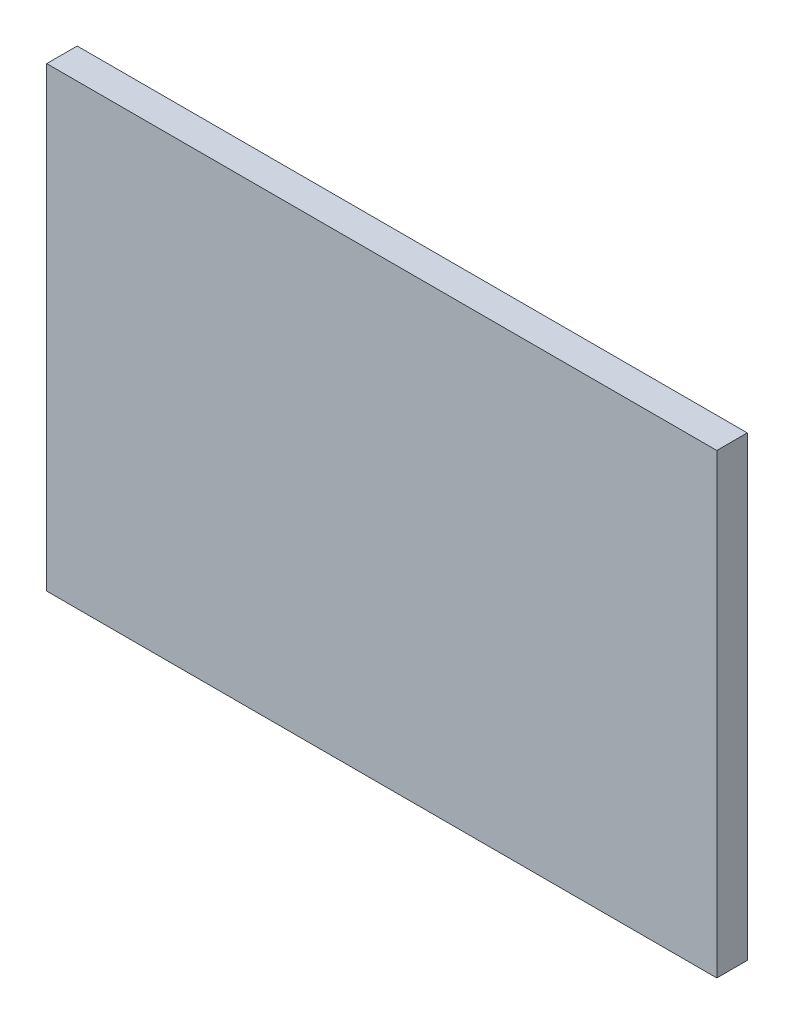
from build123d import *

# Parameters (mm, degrees)
SKETCH1_W      = 22
SKETCH1_H      = 15
EXTRUDE1_DEPTH = 1


with BuildPart() as part:
    # Sketch1 → Extrude1 (new body)
    with BuildSketch(Plane.XY):
        with Locations((0, 7.441163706)):
            Rectangle(SKETCH1_W, SKETCH1_H)
    extrude(amount=EXTRUDE1_DEPTH)


solid = part.part
